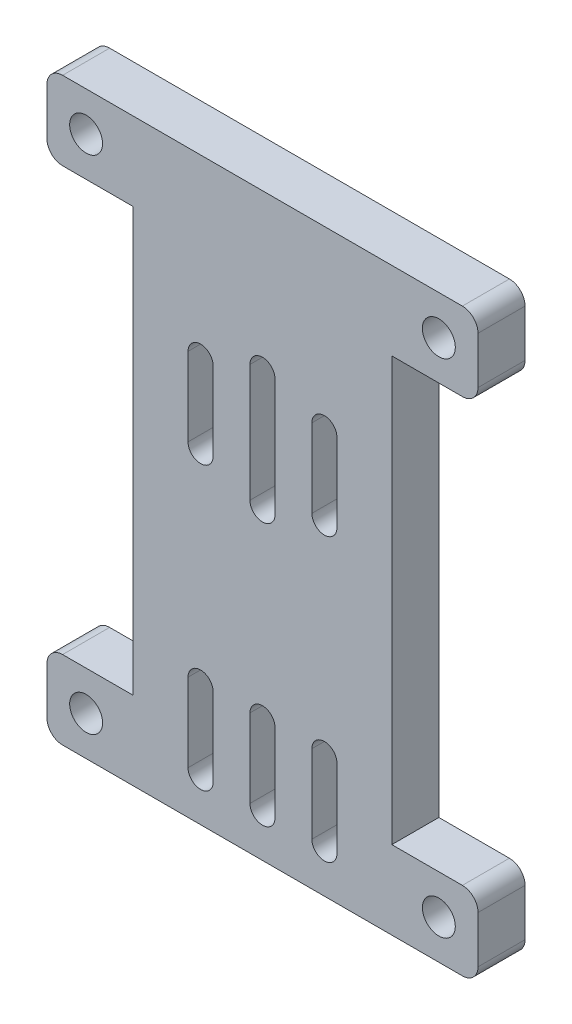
from build123d import *

# Parameters (mm, degrees)
SKETCH_1_W      = 33
SKETCH_1_H      = 69
EXTRUDE_1_DEPTH = 6
SKETCH_2_R      = 2.1
EXTRUDE_2_DEPTH = 6


with BuildPart() as part:
    # Sketch 1 → Extrude 1 (new body)
    with BuildSketch(Plane.XY):
        with Locations((16.5, 34.5)):
            Rectangle(SKETCH_1_W, SKETCH_1_H)
        with BuildLine():
            Line((10.2, 49), (10.2, 39))
            ThreePointArc((10.2, 39), (8.6, 37.4), (7, 39))
            Line((7, 39), (7, 49))
            ThreePointArc((7, 49), (8.6, 50.6), (10.2, 49))
        make_face(mode=Mode.SUBTRACT)
        with BuildLine():
            Line((18.1, 51.5), (18.1, 36.5))
            ThreePointArc((18.1, 36.5), (16.5, 34.9), (14.9, 36.5))
            Line((14.9, 36.5), (14.9, 51.5))
            ThreePointArc((14.9, 51.5), (16.5, 53.1), (18.1, 51.5))
        make_face(mode=Mode.SUBTRACT)
        with BuildLine():
            Line((26, 49), (26, 39))
            ThreePointArc((26, 39), (24.4, 37.4), (22.8, 39))
            Line((22.8, 39), (22.8, 49))
            ThreePointArc((22.8, 49), (24.4, 50.6), (26, 49))
        make_face(mode=Mode.SUBTRACT)
        with BuildLine():
            Line((18.1, 13), (18.1, 3))
            ThreePointArc((18.1, 3), (16.5, 1.4), (14.9, 3))
            Line((14.9, 3), (14.9, 13))
            ThreePointArc((14.9, 13), (16.5, 14.6), (18.1, 13))
        make_face(mode=Mode.SUBTRACT)
        with BuildLine():
            Line((10.2, 13), (10.2, 3))
            ThreePointArc((10.2, 3), (8.6, 1.4), (7, 3))
            Line((7, 3), (7, 13))
            ThreePointArc((7, 13), (8.6, 14.6), (10.2, 13))
        make_face(mode=Mode.SUBTRACT)
        with BuildLine():
            Line((26, 13), (26, 3))
            ThreePointArc((26, 3), (24.4, 1.4), (22.8, 3))
            Line((22.8, 3), (22.8, 13))
            ThreePointArc((22.8, 13), (24.4, 14.6), (26, 13))
        make_face(mode=Mode.SUBTRACT)
    extrude(amount=EXTRUDE_1_DEPTH)

    # Sketch 2 → Extrude 2 (add)
    # profile 1 of 2: a face of its own
    with BuildSketch(Plane.XY.offset(6)):
        with BuildLine():
            Line((42, 71.5), (-9, 71.5))
            ThreePointArc((-9, 71.5), (-10.414213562, 70.914213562), (-11, 69.5))
            Line((-11, 69.5), (-11, 63.5))
            ThreePointArc((-11, 63.5), (-10.414213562, 62.085786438), (-9, 61.5))
            Line((-9, 61.5), (0, 61.5))
            Line((0, 61.5), (0, 69))
            Line((0, 69), (33, 69))
            Line((33, 69), (33, 61.5))
            Line((33, 61.5), (42, 61.5))
            ThreePointArc((42, 61.5), (43.414213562, 62.085786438), (44, 63.5))
            Line((44, 63.5), (44, 69.5))
            ThreePointArc((44, 69.5), (43.414213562, 70.914213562), (42, 71.5))
        make_face()
        with Locations((-6, 66.5)):
            Circle(SKETCH_2_R, mode=Mode.SUBTRACT)
        with Locations((39, 66.5)):
            Circle(SKETCH_2_R, mode=Mode.SUBTRACT)
    # profile 2 of 2: a face of its own
    with BuildSketch(Plane.XY.offset(6)):
        with BuildLine():
            Line((0, 0), (0, 7.5))
            Line((0, 7.5), (-9, 7.5))
            ThreePointArc((-9, 7.5), (-10.414213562, 6.914213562), (-11, 5.5))
            Line((-11, 5.5), (-11, -0.5))
            ThreePointArc((-11, -0.5), (-10.414213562, -1.914213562), (-9, -2.5))
            Line((-9, -2.5), (42, -2.5))
            ThreePointArc((42, -2.5), (43.414213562, -1.914213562), (44, -0.5))
            Line((44, -0.5), (44, 5.5))
            ThreePointArc((44, 5.5), (43.414213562, 6.914213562), (42, 7.5))
            Line((42, 7.5), (33, 7.5))
            Line((33, 7.5), (33, 0))
            Line((33, 0), (0, 0))
        make_face()
        with Locations((-6, 2.5)):
            Circle(SKETCH_2_R, mode=Mode.SUBTRACT)
        with Locations((39, 2.5)):
            Circle(SKETCH_2_R, mode=Mode.SUBTRACT)
    extrude(amount=-EXTRUDE_2_DEPTH)


solid = part.part
